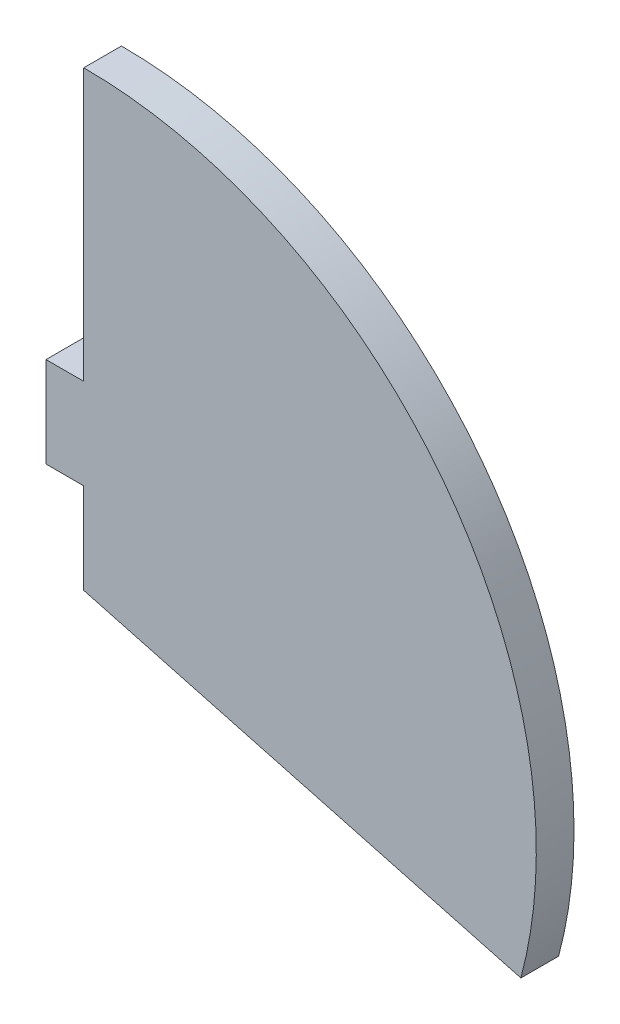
from build123d import *

# Parameters (mm, degrees)
EXTRUDE_1_DEPTH = 2.5


with BuildPart() as part:
    # Sketch 1 → Extrude 1 (new body)
    with BuildSketch(Plane.XY):
        with BuildLine():
            Line((0, 0), (0, 6))
            Line((0, 6), (-2.5, 6))
            Line((-2.5, 6), (-2.5, 12))
            Line((-2.5, 12), (0, 12))
            Line((0, 12), (0, 30))
            ThreePointArc((0, 30), (23.800600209, 18.26284287), (28.977774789, -7.764571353))
            Line((28.977774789, -7.764571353), (0, 0))
        make_face()
    extrude(amount=EXTRUDE_1_DEPTH)


solid = part.part
